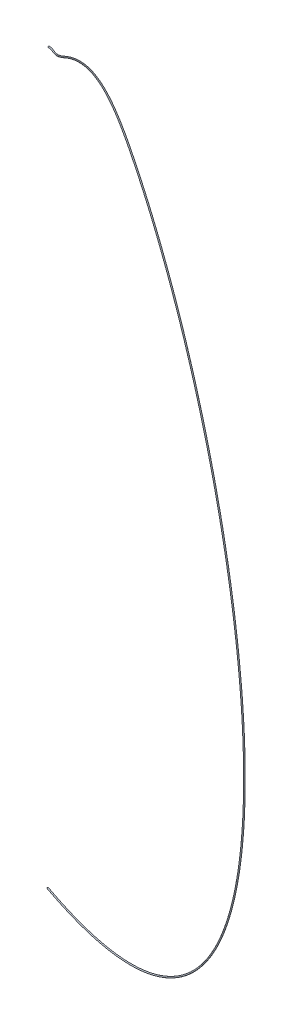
ISO-10303-21;
HEADER;
FILE_DESCRIPTION(('STEP AP214'),'2;1');
FILE_NAME('part.step','',(''),(''),'','','');
FILE_SCHEMA(('AUTOMOTIVE_DESIGN { 1 0 10303 214 1 1 1 1 }'));
ENDSEC;
DATA;
#1=APPLICATION_CONTEXT('core data for automotive mechanical design processes');
#2=APPLICATION_PROTOCOL_DEFINITION('international standard','automotive_design',2000,#1);
#3=PRODUCT_CONTEXT('',#1,'mechanical');
#4=PRODUCT('Part','Part','',(#3));
#5=PRODUCT_RELATED_PRODUCT_CATEGORY('part','',(#4));
#6=PRODUCT_DEFINITION_FORMATION('','',#4);
#7=PRODUCT_DEFINITION_CONTEXT('part definition',#1,'design');
#8=PRODUCT_DEFINITION('design','',#6,#7);
#9=PRODUCT_DEFINITION_SHAPE('','',#8);
#10=(LENGTH_UNIT() NAMED_UNIT(*) SI_UNIT(.MILLI.,.METRE.));
#11=(NAMED_UNIT(*) PLANE_ANGLE_UNIT() SI_UNIT($,.RADIAN.));
#12=(NAMED_UNIT(*) SI_UNIT($,.STERADIAN.) SOLID_ANGLE_UNIT());
#13=UNCERTAINTY_MEASURE_WITH_UNIT(LENGTH_MEASURE(1.E-05),#10,'distance_accuracy_value','');
#14=(GEOMETRIC_REPRESENTATION_CONTEXT(3) GLOBAL_UNCERTAINTY_ASSIGNED_CONTEXT((#13)) GLOBAL_UNIT_ASSIGNED_CONTEXT((#10,
#11,#12)) REPRESENTATION_CONTEXT('',''));
#15=CARTESIAN_POINT('',(0.,0.,0.));
#16=DIRECTION('',(0.,0.,1.));
#17=DIRECTION('',(1.,0.,0.));
#18=AXIS2_PLACEMENT_3D('',#15,#16,#17);
#19=CARTESIAN_POINT('',(0.,0.,3.9624));
#20=DIRECTION('',(-1.,0.,0.));
#21=DIRECTION('',(0.,0.,1.));
#22=AXIS2_PLACEMENT_3D('',#19,#20,#21);
#23=PLANE('',#22);
#24=CARTESIAN_POINT('',(0.,0.,0.));
#25=DIRECTION('',(1.,0.,0.));
#26=DIRECTION('',(0.,0.,-1.));
#27=AXIS2_PLACEMENT_3D('',#24,#25,#26);
#28=CIRCLE('',#27,3.9624);
#29=CARTESIAN_POINT('',(0.,0.,-3.9624));
#30=VERTEX_POINT('',#29);
#31=EDGE_CURVE('E52',#30,#30,#28,.T.);
#32=ORIENTED_EDGE('',*,*,#31,.F.);
#33=EDGE_LOOP('',(#32));
#34=FACE_BOUND('',#33,.T.);
#35=ADVANCED_FACE('F48',(#34),#23,.T.);
#36=CARTESIAN_POINT('',(-201.480215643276,-5173.57110164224,-191.7943457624));
#37=DIRECTION('',(0.833987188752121,-0.551779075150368,0.00228499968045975));
#38=DIRECTION('',(0.551780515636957,0.833989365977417,0.));
#39=AXIS2_PLACEMENT_3D('',#36,#37,#38);
#40=PLANE('',#39);
#41=CARTESIAN_POINT('',(-202.702073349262,-5175.43145565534,-195.072570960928));
#42=DIRECTION('',(0.833987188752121,-0.551779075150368,0.00228499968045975));
#43=DIRECTION('',(0.551780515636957,0.833989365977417,0.));
#44=AXIS2_PLACEMENT_3D('',#41,#42,#43);
#45=CIRCLE('',#44,3.96239999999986);
#46=CARTESIAN_POINT('',(-200.515698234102,-5172.12685619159,-195.072570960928));
#47=VERTEX_POINT('',#46);
#48=EDGE_CURVE('E11',#47,#47,#45,.T.);
#49=ORIENTED_EDGE('',*,*,#48,.F.);
#50=EDGE_LOOP('',(#49));
#51=FACE_BOUND('',#50,.T.);
#52=ADVANCED_FACE('F50',(#51),#40,.F.);
#53=CARTESIAN_POINT('',(0.,0.,-3.9624));
#54=CARTESIAN_POINT('',(3.52162884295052,0.172032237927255,-4.01551608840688));
#55=CARTESIAN_POINT('',(7.26533301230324,0.354912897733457,-4.07198169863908));
#56=CARTESIAN_POINT('',(14.4567207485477,0.000890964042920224,-3.87219417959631));
#57=CARTESIAN_POINT('',(21.7878451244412,-1.08923969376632,-3.34562373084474));
#58=CARTESIAN_POINT('',(31.5211141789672,-4.06815903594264,-1.80556059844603));
#59=CARTESIAN_POINT('',(39.2630979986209,-8.34152364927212,-0.423107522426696));
#60=CARTESIAN_POINT('',(43.404452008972,-11.6840371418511,-0.458403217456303));
#61=CARTESIAN_POINT('',(47.045478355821,-15.0474250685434,-1.35634812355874));
#62=CARTESIAN_POINT('',(50.3345212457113,-18.6373420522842,-3.42245670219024));
#63=CARTESIAN_POINT('',(55.7613641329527,-26.0462737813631,-9.11028691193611));
#64=CARTESIAN_POINT('',(59.6881915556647,-35.6697464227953,-20.5369656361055));
#65=CARTESIAN_POINT('',(60.416459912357,-47.1197499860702,-39.0295573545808));
#66=CARTESIAN_POINT('',(60.0624571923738,-56.613440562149,-55.03147370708));
#67=CARTESIAN_POINT('',(58.914787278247,-69.7734939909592,-77.4205349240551));
#68=CARTESIAN_POINT('',(57.7527081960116,-87.2828910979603,-105.272060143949));
#69=CARTESIAN_POINT('',(62.7576843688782,-114.470440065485,-137.708565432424));
#70=CARTESIAN_POINT('',(72.9551551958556,-153.083483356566,-175.636222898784));
#71=CARTESIAN_POINT('',(94.0064886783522,-205.259358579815,-211.008044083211));
#72=CARTESIAN_POINT('',(129.451019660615,-273.333048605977,-237.38101437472));
#73=CARTESIAN_POINT('',(203.808288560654,-398.185836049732,-260.032715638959));
#74=CARTESIAN_POINT('',(332.644063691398,-593.699089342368,-245.402533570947));
#75=CARTESIAN_POINT('',(538.538354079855,-984.083802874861,-225.729037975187));
#76=CARTESIAN_POINT('',(764.506384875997,-1552.87790215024,-209.17863563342));
#77=CARTESIAN_POINT('',(983.674816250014,-2352.06459343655,-199.787157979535));
#78=CARTESIAN_POINT('',(1125.19912917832,-3208.06684271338,-198.949350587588));
#79=CARTESIAN_POINT('',(1153.79318658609,-3910.65410020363,-203.074875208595));
#80=CARTESIAN_POINT('',(1108.78825786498,-4411.18819253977,-207.298341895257));
#81=CARTESIAN_POINT('',(1035.59151159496,-4747.01986181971,-210.422685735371));
#82=CARTESIAN_POINT('',(937.521519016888,-4983.21559782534,-212.49876123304));
#83=CARTESIAN_POINT('',(831.286144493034,-5139.72689859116,-213.509894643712));
#84=CARTESIAN_POINT('',(731.747159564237,-5239.32522808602,-213.795141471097));
#85=CARTESIAN_POINT('',(616.934296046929,-5311.44228233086,-213.450905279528));
#86=CARTESIAN_POINT('',(495.117377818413,-5351.03260316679,-212.441761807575));
#87=CARTESIAN_POINT('',(369.453101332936,-5362.94426299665,-210.847240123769));
#88=CARTESIAN_POINT('',(242.950131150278,-5352.47532107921,-208.782130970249));
#89=CARTESIAN_POINT('',(105.70915379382,-5319.47570536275,-206.069823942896));
#90=CARTESIAN_POINT('',(-42.5254944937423,-5262.87311234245,-202.655928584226));
#91=CARTESIAN_POINT('',(-148.840968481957,-5208.68307539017,-199.876025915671));
#92=CARTESIAN_POINT('',(-203.923931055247,-5177.29180966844,-198.350796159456));
#93=CARTESIAN_POINT('',(0.,7.9248,-3.9624));
#94=CARTESIAN_POINT('',(3.8374521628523,8.106030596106,-4.16578515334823));
#95=CARTESIAN_POINT('',(7.91689559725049,8.29868966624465,-4.38199585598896));
#96=CARTESIAN_POINT('',(16.2897062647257,7.70801725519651,-3.46272132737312));
#97=CARTESIAN_POINT('',(25.2347393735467,6.12023941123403,-1.28568068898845));
#98=CARTESIAN_POINT('',(34.9877412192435,0.978598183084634,3.79112845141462));
#99=CARTESIAN_POINT('',(41.9969815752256,-6.52383157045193,6.9832751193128));
#100=CARTESIAN_POINT('',(46.0036986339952,-11.6431391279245,7.05558076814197));
#101=CARTESIAN_POINT('',(50.0049292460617,-16.2503818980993,5.92827421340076));
#102=CARTESIAN_POINT('',(54.3540917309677,-20.4370778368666,3.24761153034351));
#103=CARTESIAN_POINT('',(60.7809811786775,-29.6202772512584,-3.87929279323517));
#104=CARTESIAN_POINT('',(65.0578605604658,-40.4712720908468,-17.0566874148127));
#105=CARTESIAN_POINT('',(66.3933135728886,-51.8577245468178,-36.9055232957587));
#106=CARTESIAN_POINT('',(65.7341121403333,-61.7863027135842,-52.8247996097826));
#107=CARTESIAN_POINT('',(65.0687260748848,-74.1181425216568,-75.5575829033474));
#108=CARTESIAN_POINT('',(65.9923184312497,-88.2138329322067,-104.52193342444));
#109=CARTESIAN_POINT('',(70.1365389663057,-116.157616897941,-135.555461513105));
#110=CARTESIAN_POINT('',(80.3971414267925,-153.603319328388,-172.684916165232));
#111=CARTESIAN_POINT('',(100.822977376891,-204.903233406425,-206.89913542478));
#112=CARTESIAN_POINT('',(135.614108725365,-271.835431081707,-232.551744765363));
#113=CARTESIAN_POINT('',(208.491808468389,-395.804568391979,-253.982153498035));
#114=CARTESIAN_POINT('',(337.062287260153,-591.079810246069,-239.169668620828));
#115=CARTESIAN_POINT('',(544.163743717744,-982.143218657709,-220.51996217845));
#116=CARTESIAN_POINT('',(770.035608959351,-1551.49819849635,-203.642671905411));
#117=CARTESIAN_POINT('',(989.684895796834,-2351.29469646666,-194.660622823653));
#118=CARTESIAN_POINT('',(1131.44708787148,-3207.94383891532,-194.05567178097));
#119=CARTESIAN_POINT('',(1160.17558764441,-3911.27281656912,-198.389305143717));
#120=CARTESIAN_POINT('',(1115.10252740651,-4412.68829540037,-202.728034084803));
#121=CARTESIAN_POINT('',(1041.68590200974,-4749.43149987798,-205.922928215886));
#122=CARTESIAN_POINT('',(943.124304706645,-4986.71116189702,-208.045196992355));
#123=CARTESIAN_POINT('',(836.045832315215,-5144.31799292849,-209.085663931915));
#124=CARTESIAN_POINT('',(735.482232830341,-5244.81670508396,-209.387176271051));
#125=CARTESIAN_POINT('',(619.268583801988,-5317.67814213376,-209.049340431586));
#126=CARTESIAN_POINT('',(495.947621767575,-5357.62047217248,-208.035915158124));
#127=CARTESIAN_POINT('',(368.952462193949,-5369.53973957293,-206.43158930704));
#128=CARTESIAN_POINT('',(241.383390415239,-5358.88503982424,-204.355599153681));
#129=CARTESIAN_POINT('',(103.277636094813,-5325.59371336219,-201.632967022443));
#130=CARTESIAN_POINT('',(-45.6455304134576,-5268.65960738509,-198.210384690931));
#131=CARTESIAN_POINT('',(-152.298456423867,-5214.25351490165,-195.426568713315));
#132=CARTESIAN_POINT('',(-207.550145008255,-5182.75422141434,-193.899382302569));
#133=CARTESIAN_POINT('',(0.,7.9248,3.9624));
#134=CARTESIAN_POINT('',(3.77614200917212,8.25050685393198,3.75646396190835));
#135=CARTESIAN_POINT('',(7.79040904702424,8.59675291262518,3.53754151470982));
#136=CARTESIAN_POINT('',(15.7383437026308,7.41804126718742,4.45365539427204));
#137=CARTESIAN_POINT('',(23.9730319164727,4.44127706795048,6.58795003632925));
#138=CARTESIAN_POINT('',(31.9846661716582,-3.72190547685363,9.90322335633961));
#139=CARTESIAN_POINT('',(37.6056454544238,-12.5484770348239,10.0682338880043));
#140=CARTESIAN_POINT('',(41.0109215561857,-17.5554537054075,8.80520254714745));
#141=CARTESIAN_POINT('',(44.6376497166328,-21.9579907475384,7.15651694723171));
#142=CARTESIAN_POINT('',(48.8807759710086,-25.8981497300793,5.02192469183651));
#143=CARTESIAN_POINT('',(54.9909684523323,-34.6523275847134,-1.86825436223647));
#144=CARTESIAN_POINT('',(59.1491577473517,-45.1073779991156,-14.446204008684));
#145=CARTESIAN_POINT('',(61.2345383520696,-56.9202758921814,-33.6830359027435));
#146=CARTESIAN_POINT('',(60.1576428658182,-66.5707341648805,-49.6954918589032));
#147=CARTESIAN_POINT('',(60.389489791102,-79.2267839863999,-72.0506082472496));
#148=CARTESIAN_POINT('',(64.8385136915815,-94.8684788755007,-99.6872385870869));
#149=CARTESIAN_POINT('',(67.4621386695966,-121.747003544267,-130.70240592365));
#150=CARTESIAN_POINT('',(77.9141726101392,-158.826479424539,-167.189373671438));
#151=CARTESIAN_POINT('',(97.6160158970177,-209.218170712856,-201.048343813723));
#152=CARTESIAN_POINT('',(131.831322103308,-275.418595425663,-226.552699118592));
#153=CARTESIAN_POINT('',(203.3241672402,-398.838992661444,-248.700291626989));
#154=CARTESIAN_POINT('',(331.472254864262,-593.588157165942,-233.968746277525));
#155=CARTESIAN_POINT('',(539.25840658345,-984.085659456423,-214.653692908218));
#156=CARTESIAN_POINT('',(764.708339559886,-1552.97235482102,-197.931192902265));
#157=CARTESIAN_POINT('',(984.627462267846,-2352.23154011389,-188.626209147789));
#158=CARTESIAN_POINT('',(1126.55627798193,-3208.36203559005,-187.823218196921));
#159=CARTESIAN_POINT('',(1155.46882773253,-3911.16235560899,-192.003776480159));
#160=CARTESIAN_POINT('',(1110.56843515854,-4411.97143845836,-196.260089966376));
#161=CARTESIAN_POINT('',(1037.35939633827,-4748.08711285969,-199.405602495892));
#162=CARTESIAN_POINT('',(939.148643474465,-4984.61005690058,-201.495569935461));
#163=CARTESIAN_POINT('',(832.644048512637,-5141.43600591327,-202.51510866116));
#164=CARTESIAN_POINT('',(732.776370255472,-5241.27962760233,-202.804576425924));
#165=CARTESIAN_POINT('',(617.522063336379,-5313.58003698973,-202.461283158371));
#166=CARTESIAN_POINT('',(495.243253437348,-5353.23038923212,-201.449842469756));
#167=CARTESIAN_POINT('',(369.179610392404,-5365.10427736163,-199.851559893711));
#168=CARTESIAN_POINT('',(242.362436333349,-5354.5489011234,-197.782596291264));
#169=CARTESIAN_POINT('',(104.870179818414,-5321.43893275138,-195.066772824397));
#170=CARTESIAN_POINT('',(-43.5626588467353,-5264.72094181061,-191.649986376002));
#171=CARTESIAN_POINT('',(-149.975022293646,-5210.46015435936,-188.868802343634));
#172=CARTESIAN_POINT('',(-205.106429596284,-5179.03351338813,-187.342931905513));
#173=CARTESIAN_POINT('',(0.,0.,3.9624));
#174=CARTESIAN_POINT('',(3.46031868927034,0.316508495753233,3.9067330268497));
#175=CARTESIAN_POINT('',(7.138846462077,0.652976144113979,3.8475556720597));
#176=CARTESIAN_POINT('',(13.9053581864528,-0.28908502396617,4.04418254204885));
#177=CARTESIAN_POINT('',(20.5261376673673,-2.76820203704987,4.52800699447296));
#178=CARTESIAN_POINT('',(28.518039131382,-8.76866269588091,4.30653430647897));
#179=CARTESIAN_POINT('',(34.8717618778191,-14.3661691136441,2.66185124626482));
#180=CARTESIAN_POINT('',(38.4116749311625,-17.5963517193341,1.29121856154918));
#181=CARTESIAN_POINT('',(41.6781988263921,-20.7550339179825,-0.128105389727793));
#182=CARTESIAN_POINT('',(44.8612054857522,-24.0984139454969,-1.64814354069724));
#183=CARTESIAN_POINT('',(49.9713514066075,-31.0783241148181,-7.09924848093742));
#184=CARTESIAN_POINT('',(53.7794887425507,-40.3058523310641,-17.9264822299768));
#185=CARTESIAN_POINT('',(55.2576846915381,-52.1823013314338,-35.8070699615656));
#186=CARTESIAN_POINT('',(54.4859879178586,-61.3978720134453,-51.9021659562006));
#187=CARTESIAN_POINT('',(54.2355509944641,-74.8821354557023,-73.9135602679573));
#188=CARTESIAN_POINT('',(56.5989034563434,-93.9375370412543,-100.437365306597));
#189=CARTESIAN_POINT('',(60.0832840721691,-120.059826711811,-132.855509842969));
#190=CARTESIAN_POINT('',(70.4721863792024,-158.306643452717,-170.140680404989));
#191=CARTESIAN_POINT('',(90.7995271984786,-209.574295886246,-205.157252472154));
#192=CARTESIAN_POINT('',(125.668233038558,-276.916212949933,-231.381968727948));
#193=CARTESIAN_POINT('',(198.640647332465,-401.220260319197,-254.750853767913));
#194=CARTESIAN_POINT('',(327.054031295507,-596.207436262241,-240.201611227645));
#195=CARTESIAN_POINT('',(533.633016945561,-986.026243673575,-219.862768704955));
#196=CARTESIAN_POINT('',(759.179115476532,-1554.35205847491,-203.467156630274));
#197=CARTESIAN_POINT('',(978.617382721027,-2353.00143708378,-193.752744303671));
#198=CARTESIAN_POINT('',(1120.30831928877,-3208.48503938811,-192.716897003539));
#199=CARTESIAN_POINT('',(1149.08642667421,-3910.54363924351,-196.689346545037));
#200=CARTESIAN_POINT('',(1104.25416561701,-4410.47133559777,-200.83039777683));
#201=CARTESIAN_POINT('',(1031.2650059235,-4745.67547480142,-203.905360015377));
#202=CARTESIAN_POINT('',(933.545857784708,-4981.1144928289,-205.949134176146));
#203=CARTESIAN_POINT('',(827.884360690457,-5136.84491157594,-206.939339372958));
#204=CARTESIAN_POINT('',(729.041296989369,-5235.78815060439,-207.21254162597));
#205=CARTESIAN_POINT('',(615.187775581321,-5307.34417718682,-206.862848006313));
#206=CARTESIAN_POINT('',(494.413009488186,-5346.64252022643,-205.855689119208));
#207=CARTESIAN_POINT('',(369.680249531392,-5358.50880078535,-204.267210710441));
#208=CARTESIAN_POINT('',(243.929177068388,-5348.13918237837,-202.209128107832));
#209=CARTESIAN_POINT('',(107.301697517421,-5315.32092475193,-199.50362974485));
#210=CARTESIAN_POINT('',(-40.4426229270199,-5258.93444676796,-196.095530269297));
#211=CARTESIAN_POINT('',(-146.517534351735,-5204.88971484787,-193.31825954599));
#212=CARTESIAN_POINT('',(-201.480215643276,-5173.57110164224,-191.7943457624));
#213=CARTESIAN_POINT('',(0.,-7.9248,3.9624));
#214=CARTESIAN_POINT('',(3.14449536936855,-7.61748986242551,4.05700209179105));
#215=CARTESIAN_POINT('',(6.48728387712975,-7.29080062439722,4.15756982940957));
#216=CARTESIAN_POINT('',(12.0723726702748,-7.99621131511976,3.63470968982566));
#217=CARTESIAN_POINT('',(17.0792434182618,-9.97768114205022,2.46806395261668));
#218=CARTESIAN_POINT('',(25.0514120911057,-13.8154199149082,-1.29015474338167));
#219=CARTESIAN_POINT('',(32.1378783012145,-16.1838611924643,-4.74453139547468));
#220=CARTESIAN_POINT('',(35.8124283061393,-17.6372497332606,-6.22276542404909));
#221=CARTESIAN_POINT('',(38.7187479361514,-19.5520770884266,-7.4127277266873));
#222=CARTESIAN_POINT('',(40.8416350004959,-22.2986781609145,-8.318211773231));
#223=CARTESIAN_POINT('',(44.9517343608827,-27.5043206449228,-12.3302425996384));
#224=CARTESIAN_POINT('',(48.4098197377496,-35.5043266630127,-21.4067604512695));
#225=CARTESIAN_POINT('',(49.2808310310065,-47.4443267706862,-37.9311040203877));
#226=CARTESIAN_POINT('',(48.8143329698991,-56.22500986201,-54.108840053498));
#227=CARTESIAN_POINT('',(48.0816121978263,-70.5374869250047,-75.7765122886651));
#228=CARTESIAN_POINT('',(48.3592932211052,-93.0065952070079,-101.187492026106));
#229=CARTESIAN_POINT('',(52.7044294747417,-118.372649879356,-135.008613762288));
#230=CARTESIAN_POINT('',(63.0302001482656,-157.786807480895,-173.09198713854));
#231=CARTESIAN_POINT('',(83.9830384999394,-209.930421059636,-209.266161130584));
#232=CARTESIAN_POINT('',(119.505143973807,-278.413830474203,-236.211238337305));
#233=CARTESIAN_POINT('',(193.95712742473,-403.601527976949,-260.801415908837));
#234=CARTESIAN_POINT('',(322.635807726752,-598.826715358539,-246.434476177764));
#235=CARTESIAN_POINT('',(528.007627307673,-987.966827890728,-225.071844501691));
#236=CARTESIAN_POINT('',(753.649891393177,-1555.73176212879,-209.003120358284));
#237=CARTESIAN_POINT('',(972.607303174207,-2353.77133405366,-198.879279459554));
#238=CARTESIAN_POINT('',(1114.06036059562,-3208.60804318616,-197.610575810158));
#239=CARTESIAN_POINT('',(1142.7040256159,-3909.92492287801,-201.374916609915));
#240=CARTESIAN_POINT('',(1097.93989607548,-4408.97123273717,-205.400705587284));
#241=CARTESIAN_POINT('',(1025.17061550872,-4743.26383674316,-208.405117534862));
#242=CARTESIAN_POINT('',(927.943072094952,-4977.61892875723,-210.402698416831));
#243=CARTESIAN_POINT('',(823.124672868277,-5132.2538172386,-211.363570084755));
#244=CARTESIAN_POINT('',(725.306223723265,-5230.29667360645,-211.620506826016));
#245=CARTESIAN_POINT('',(612.853487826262,-5301.10831738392,-211.264412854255));
#246=CARTESIAN_POINT('',(493.582765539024,-5340.05465122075,-210.261535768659));
#247=CARTESIAN_POINT('',(370.18088867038,-5351.91332420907,-208.68286152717));
#248=CARTESIAN_POINT('',(245.495917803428,-5341.72946363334,-206.6356599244));
#249=CARTESIAN_POINT('',(109.733215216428,-5309.2029167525,-203.940486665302));
#250=CARTESIAN_POINT('',(-37.3225870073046,-5253.14795172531,-200.541074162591));
#251=CARTESIAN_POINT('',(-143.060046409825,-5199.31927533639,-197.767716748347));
#252=CARTESIAN_POINT('',(-197.854001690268,-5168.10868989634,-196.245759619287));
#253=CARTESIAN_POINT('',(0.,-7.9248,-3.9624));
#254=CARTESIAN_POINT('',(3.20580552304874,-7.76196612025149,-3.86524702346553));
#255=CARTESIAN_POINT('',(6.61377042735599,-7.58886387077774,-3.76196754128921));
#256=CARTESIAN_POINT('',(12.6237352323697,-7.70623532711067,-4.2816670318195));
#257=CARTESIAN_POINT('',(18.3409508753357,-8.29871879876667,-5.40556677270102));
#258=CARTESIAN_POINT('',(28.0544871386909,-9.11491625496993,-7.40224964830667));
#259=CARTESIAN_POINT('',(36.5292144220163,-10.1592157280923,-7.8294901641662));
#260=CARTESIAN_POINT('',(40.8052053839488,-11.7249351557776,-7.97238720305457));
#261=CARTESIAN_POINT('',(44.0860274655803,-13.8444682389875,-8.64097046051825));
#262=CARTESIAN_POINT('',(46.314950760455,-16.8376062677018,-10.092524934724));
#263=CARTESIAN_POINT('',(50.7417470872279,-22.4722703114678,-14.3412810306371));
#264=CARTESIAN_POINT('',(54.3185225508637,-30.8682207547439,-24.0172438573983));
#265=CARTESIAN_POINT('',(54.4396062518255,-42.3817754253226,-41.1535914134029));
#266=CARTESIAN_POINT('',(54.3908022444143,-51.4405784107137,-57.2381478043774));
#267=CARTESIAN_POINT('',(52.7608484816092,-65.4288454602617,-79.2834869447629));
#268=CARTESIAN_POINT('',(49.5130979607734,-86.351949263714,-106.022186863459));
#269=CARTESIAN_POINT('',(55.3788297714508,-112.78326323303,-139.861669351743));
#270=CARTESIAN_POINT('',(65.5131689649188,-152.563647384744,-178.587529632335));
#271=CARTESIAN_POINT('',(87.189999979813,-205.615483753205,-215.116952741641));
#272=CARTESIAN_POINT('',(123.287930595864,-274.830666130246,-242.210283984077));
#273=CARTESIAN_POINT('',(199.124768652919,-400.567103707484,-266.083277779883));
#274=CARTESIAN_POINT('',(328.225840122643,-596.318368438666,-251.635398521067));
#275=CARTESIAN_POINT('',(532.912964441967,-986.024387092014,-230.938113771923));
#276=CARTESIAN_POINT('',(758.977160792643,-1554.25760580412,-214.71459936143));
#277=CARTESIAN_POINT('',(977.664736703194,-2352.83449040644,-204.913693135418));
#278=CARTESIAN_POINT('',(1118.95117048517,-3208.18984651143,-203.843029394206));
#279=CARTESIAN_POINT('',(1147.41078552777,-3910.03538383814,-207.760445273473));
#280=CARTESIAN_POINT('',(1102.47398832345,-4409.68808967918,-211.868649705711));
#281=CARTESIAN_POINT('',(1029.49712118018,-4744.60822376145,-214.922443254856));
#282=CARTESIAN_POINT('',(931.918733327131,-4979.72003375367,-216.952325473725));
#283=CARTESIAN_POINT('',(826.526456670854,-5135.13580425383,-217.934125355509));
#284=CARTESIAN_POINT('',(728.012086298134,-5233.83375108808,-218.203106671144));
#285=CARTESIAN_POINT('',(614.600008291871,-5305.20642252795,-217.85247012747));
#286=CARTESIAN_POINT('',(494.287133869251,-5344.44473416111,-216.847608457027));
#287=CARTESIAN_POINT('',(369.953740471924,-5356.34878642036,-215.262890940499));
#288=CARTESIAN_POINT('',(244.516871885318,-5346.06560233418,-213.208662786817));
#289=CARTESIAN_POINT('',(108.140671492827,-5313.35769736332,-210.506680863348));
#290=CARTESIAN_POINT('',(-39.4054585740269,-5257.0866172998,-207.101472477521));
#291=CARTESIAN_POINT('',(-145.383480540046,-5203.11263587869,-204.325483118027));
#292=CARTESIAN_POINT('',(-200.297717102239,-5171.82939792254,-202.802210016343));
#293=CARTESIAN_POINT('',(0.,0.,-3.9624));
#294=CARTESIAN_POINT('',(3.52162884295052,0.172032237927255,-4.01551608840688));
#295=CARTESIAN_POINT('',(7.26533301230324,0.354912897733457,-4.07198169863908));
#296=CARTESIAN_POINT('',(14.4567207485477,0.000890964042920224,-3.87219417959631));
#297=CARTESIAN_POINT('',(21.7878451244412,-1.08923969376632,-3.34562373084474));
#298=CARTESIAN_POINT('',(31.5211141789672,-4.06815903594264,-1.80556059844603));
#299=CARTESIAN_POINT('',(39.2630979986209,-8.34152364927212,-0.423107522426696));
#300=CARTESIAN_POINT('',(43.404452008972,-11.6840371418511,-0.458403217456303));
#301=CARTESIAN_POINT('',(47.045478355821,-15.0474250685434,-1.35634812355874));
#302=CARTESIAN_POINT('',(50.3345212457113,-18.6373420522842,-3.42245670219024));
#303=CARTESIAN_POINT('',(55.7613641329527,-26.0462737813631,-9.11028691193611));
#304=CARTESIAN_POINT('',(59.6881915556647,-35.6697464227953,-20.5369656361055));
#305=CARTESIAN_POINT('',(60.416459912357,-47.1197499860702,-39.0295573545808));
#306=CARTESIAN_POINT('',(60.0624571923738,-56.613440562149,-55.03147370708));
#307=CARTESIAN_POINT('',(58.914787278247,-69.7734939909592,-77.4205349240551));
#308=CARTESIAN_POINT('',(57.7527081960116,-87.2828910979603,-105.272060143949));
#309=CARTESIAN_POINT('',(62.7576843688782,-114.470440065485,-137.708565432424));
#310=CARTESIAN_POINT('',(72.9551551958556,-153.083483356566,-175.636222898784));
#311=CARTESIAN_POINT('',(94.0064886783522,-205.259358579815,-211.008044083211));
#312=CARTESIAN_POINT('',(129.451019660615,-273.333048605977,-237.38101437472));
#313=CARTESIAN_POINT('',(203.808288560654,-398.185836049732,-260.032715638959));
#314=CARTESIAN_POINT('',(332.644063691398,-593.699089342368,-245.402533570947));
#315=CARTESIAN_POINT('',(538.538354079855,-984.083802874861,-225.729037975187));
#316=CARTESIAN_POINT('',(764.506384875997,-1552.87790215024,-209.17863563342));
#317=CARTESIAN_POINT('',(983.674816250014,-2352.06459343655,-199.787157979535));
#318=CARTESIAN_POINT('',(1125.19912917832,-3208.06684271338,-198.949350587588));
#319=CARTESIAN_POINT('',(1153.79318658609,-3910.65410020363,-203.074875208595));
#320=CARTESIAN_POINT('',(1108.78825786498,-4411.18819253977,-207.298341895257));
#321=CARTESIAN_POINT('',(1035.59151159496,-4747.01986181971,-210.422685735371));
#322=CARTESIAN_POINT('',(937.521519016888,-4983.21559782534,-212.49876123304));
#323=CARTESIAN_POINT('',(831.286144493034,-5139.72689859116,-213.509894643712));
#324=CARTESIAN_POINT('',(731.747159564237,-5239.32522808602,-213.795141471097));
#325=CARTESIAN_POINT('',(616.934296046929,-5311.44228233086,-213.450905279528));
#326=CARTESIAN_POINT('',(495.117377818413,-5351.03260316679,-212.441761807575));
#327=CARTESIAN_POINT('',(369.453101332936,-5362.94426299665,-210.847240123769));
#328=CARTESIAN_POINT('',(242.950131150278,-5352.47532107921,-208.782130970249));
#329=CARTESIAN_POINT('',(105.70915379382,-5319.47570536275,-206.069823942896));
#330=CARTESIAN_POINT('',(-42.5254944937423,-5262.87311234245,-202.655928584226));
#331=CARTESIAN_POINT('',(-148.840968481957,-5208.68307539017,-199.876025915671));
#332=CARTESIAN_POINT('',(-203.923931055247,-5177.29180966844,-198.350796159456));
#333=(BOUNDED_SURFACE() B_SPLINE_SURFACE(3,3,((#53,#54,#55,#56,#57,#58,#59,#60,#61,#62,#63,#64,
#65,#66,#67,#68,#69,#70,#71,#72,#73,#74,#75,#76,#77,#78,#79,#80,#81,#82,#83,#84,#85,#86,#87,#88,
#89,#90,#91,#92),(#93,#94,#95,#96,#97,#98,#99,#100,#101,#102,#103,#104,#105,#106,#107,#108,#109,
#110,#111,#112,#113,#114,#115,#116,#117,#118,#119,#120,#121,#122,#123,#124,#125,#126,#127,#128,
#129,#130,#131,#132),(#133,#134,#135,#136,#137,#138,#139,#140,#141,#142,#143,#144,#145,#146,
#147,#148,#149,#150,#151,#152,#153,#154,#155,#156,#157,#158,#159,#160,#161,#162,#163,#164,#165,
#166,#167,#168,#169,#170,#171,#172),(#173,#174,#175,#176,#177,#178,#179,#180,#181,#182,#183,
#184,#185,#186,#187,#188,#189,#190,#191,#192,#193,#194,#195,#196,#197,#198,#199,#200,#201,#202,
#203,#204,#205,#206,#207,#208,#209,#210,#211,#212),(#213,#214,#215,#216,#217,#218,#219,#220,
#221,#222,#223,#224,#225,#226,#227,#228,#229,#230,#231,#232,#233,#234,#235,#236,#237,#238,#239,
#240,#241,#242,#243,#244,#245,#246,#247,#248,#249,#250,#251,#252),(#253,#254,#255,#256,#257,
#258,#259,#260,#261,#262,#263,#264,#265,#266,#267,#268,#269,#270,#271,#272,#273,#274,#275,#276,
#277,#278,#279,#280,#281,#282,#283,#284,#285,#286,#287,#288,#289,#290,#291,#292),(#293,#294,
#295,#296,#297,#298,#299,#300,#301,#302,#303,#304,#305,#306,#307,#308,#309,#310,#311,#312,#313,
#314,#315,#316,#317,#318,#319,#320,#321,#322,#323,#324,#325,#326,#327,#328,#329,#330,#331,
#332)),.UNSPECIFIED.,.T.,.F.,.F.) B_SPLINE_SURFACE_WITH_KNOTS((4,3,4),(4,1,1,1,1,1,1,1,1,1,1,1,
1,1,1,1,1,1,1,1,1,1,1,1,1,1,1,1,1,1,1,1,1,1,1,1,1,4),(0.,0.5,1.),(0.,0.00195312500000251,
0.00207628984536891,0.00390625,0.00585937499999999,0.00732421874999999,0.00857706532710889,
0.0087890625,0.01025390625,0.01171875,0.0153937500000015,0.01906875,0.02274375,
0.0241878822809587,0.03140625,0.0391406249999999,0.046875,0.0625,0.078125,0.09375,
0.142441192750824,0.1875,0.28125,0.375,0.48,0.585,0.64,0.695,0.75,0.78125,0.8125,0.84375,0.875,
0.9,0.925,0.95,0.975,1.),
.UNSPECIFIED.) GEOMETRIC_REPRESENTATION_ITEM() RATIONAL_B_SPLINE_SURFACE(((1.,1.,1.,1.,1.,1.,1.,
1.,1.,1.,1.,1.,1.,1.,1.,1.,1.,1.,1.,1.,1.,1.,1.,1.,1.,1.,1.,1.,1.,1.,1.,1.,1.,1.,1.,1.,1.,1.,1.,
1.),(0.333333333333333,0.333333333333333,0.333333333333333,0.333333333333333,0.333333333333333,
0.333333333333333,0.333333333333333,0.333333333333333,0.333333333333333,0.333333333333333,
0.333333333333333,0.333333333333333,0.333333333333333,0.333333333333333,0.333333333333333,
0.333333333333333,0.333333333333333,0.333333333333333,0.333333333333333,0.333333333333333,
0.333333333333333,0.333333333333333,0.333333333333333,0.333333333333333,0.333333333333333,
0.333333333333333,0.333333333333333,0.333333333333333,0.333333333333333,0.333333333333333,
0.333333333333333,0.333333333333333,0.333333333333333,0.333333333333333,0.333333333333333,
0.333333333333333,0.333333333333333,0.333333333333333,0.333333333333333,0.333333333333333),
(0.333333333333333,0.333333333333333,0.333333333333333,0.333333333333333,0.333333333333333,
0.333333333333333,0.333333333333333,0.333333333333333,0.333333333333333,0.333333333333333,
0.333333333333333,0.333333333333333,0.333333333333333,0.333333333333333,0.333333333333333,
0.333333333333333,0.333333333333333,0.333333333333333,0.333333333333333,0.333333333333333,
0.333333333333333,0.333333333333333,0.333333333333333,0.333333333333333,0.333333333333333,
0.333333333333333,0.333333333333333,0.333333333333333,0.333333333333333,0.333333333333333,
0.333333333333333,0.333333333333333,0.333333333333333,0.333333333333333,0.333333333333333,
0.333333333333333,0.333333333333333,0.333333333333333,0.333333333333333,0.333333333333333),(1.,
1.,1.,1.,1.,1.,1.,1.,1.,1.,1.,1.,1.,1.,1.,1.,1.,1.,1.,1.,1.,1.,1.,1.,1.,1.,1.,1.,1.,1.,1.,1.,1.,
1.,1.,1.,1.,1.,1.,1.),(0.333333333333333,0.333333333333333,0.333333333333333,0.333333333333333,
0.333333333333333,0.333333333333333,0.333333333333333,0.333333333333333,0.333333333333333,
0.333333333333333,0.333333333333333,0.333333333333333,0.333333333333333,0.333333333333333,
0.333333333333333,0.333333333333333,0.333333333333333,0.333333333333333,0.333333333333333,
0.333333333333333,0.333333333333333,0.333333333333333,0.333333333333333,0.333333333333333,
0.333333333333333,0.333333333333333,0.333333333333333,0.333333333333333,0.333333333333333,
0.333333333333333,0.333333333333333,0.333333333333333,0.333333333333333,0.333333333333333,
0.333333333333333,0.333333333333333,0.333333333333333,0.333333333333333,0.333333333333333,
0.333333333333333),(0.333333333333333,0.333333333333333,0.333333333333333,0.333333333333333,
0.333333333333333,0.333333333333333,0.333333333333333,0.333333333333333,0.333333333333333,
0.333333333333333,0.333333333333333,0.333333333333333,0.333333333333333,0.333333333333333,
0.333333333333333,0.333333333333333,0.333333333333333,0.333333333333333,0.333333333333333,
0.333333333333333,0.333333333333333,0.333333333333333,0.333333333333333,0.333333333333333,
0.333333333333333,0.333333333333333,0.333333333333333,0.333333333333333,0.333333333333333,
0.333333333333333,0.333333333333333,0.333333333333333,0.333333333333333,0.333333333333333,
0.333333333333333,0.333333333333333,0.333333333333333,0.333333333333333,0.333333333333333,
0.333333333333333),(1.,1.,1.,1.,1.,1.,1.,1.,1.,1.,1.,1.,1.,1.,1.,1.,1.,1.,1.,1.,1.,1.,1.,1.,1.,
1.,1.,1.,1.,1.,1.,1.,1.,1.,1.,1.,1.,1.,1.,1.))) REPRESENTATION_ITEM('') SURFACE());
#334=ORIENTED_EDGE('',*,*,#31,.T.);
#335=EDGE_LOOP('',(#334));
#336=FACE_BOUND('',#335,.T.);
#337=ORIENTED_EDGE('',*,*,#48,.T.);
#338=EDGE_LOOP('',(#337));
#339=FACE_BOUND('',#338,.T.);
#340=ADVANCED_FACE('F61',(#336,#339),#333,.T.);
#341=CLOSED_SHELL('',(#35,#52,#340));
#342=MANIFOLD_SOLID_BREP('B2',#341);
#343=ADVANCED_BREP_SHAPE_REPRESENTATION('',(#18,#342),#14);
#344=SHAPE_DEFINITION_REPRESENTATION(#9,#343);
ENDSEC;
END-ISO-10303-21;
